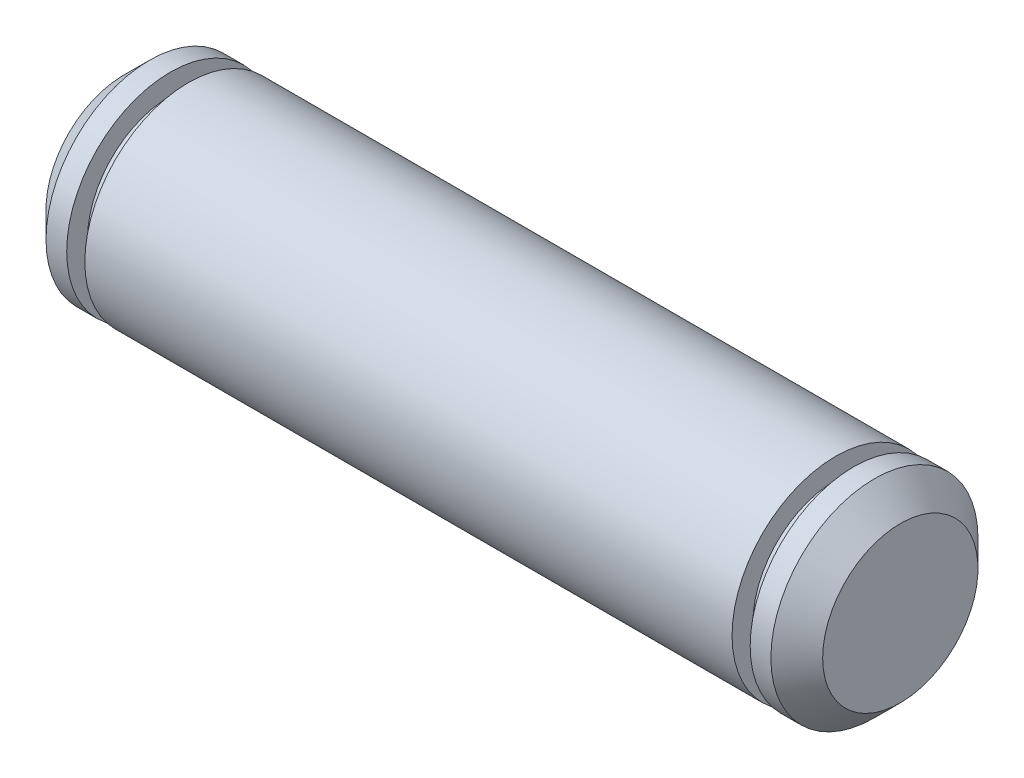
from build123d import *

# Parameters (mm, degrees)
CHANFREIN1_SIZE = 1


with BuildPart() as part:
    # Esquisse1 → Base-R_volution (revolve)
    with BuildSketch(Plane.XY, mode=Mode.PRIVATE) as base_r_volution_sk:
        Polygon((-81.8, 26.8), (-81.8, 30.8), (-80, 30.8), (-80, 30), (-79.3, 30), (-79.3, 30.8), (-54.3, 30.8), (-54.3, 30), (-53.6, 30), (-53.6, 30.8), (-51.8, 30.8), (-51.8, 26.8), align=None)
    revolve(base_r_volution_sk.sketch.rotate(Axis((-101.8, 26.8, 0), (1, 0, 0)), 90), axis=Axis((-101.8, 26.8, 0), (1, 0, 0)))

    # Chanfrein1
    chanfrein1_edges = [part.edges().sort_by_distance(p)[0] for p in [
        (-81.8, 26.8, -4),
        (-51.8, 26.8, -4),
    ]]
    chamfer(chanfrein1_edges, length=CHANFREIN1_SIZE)


solid = part.part
